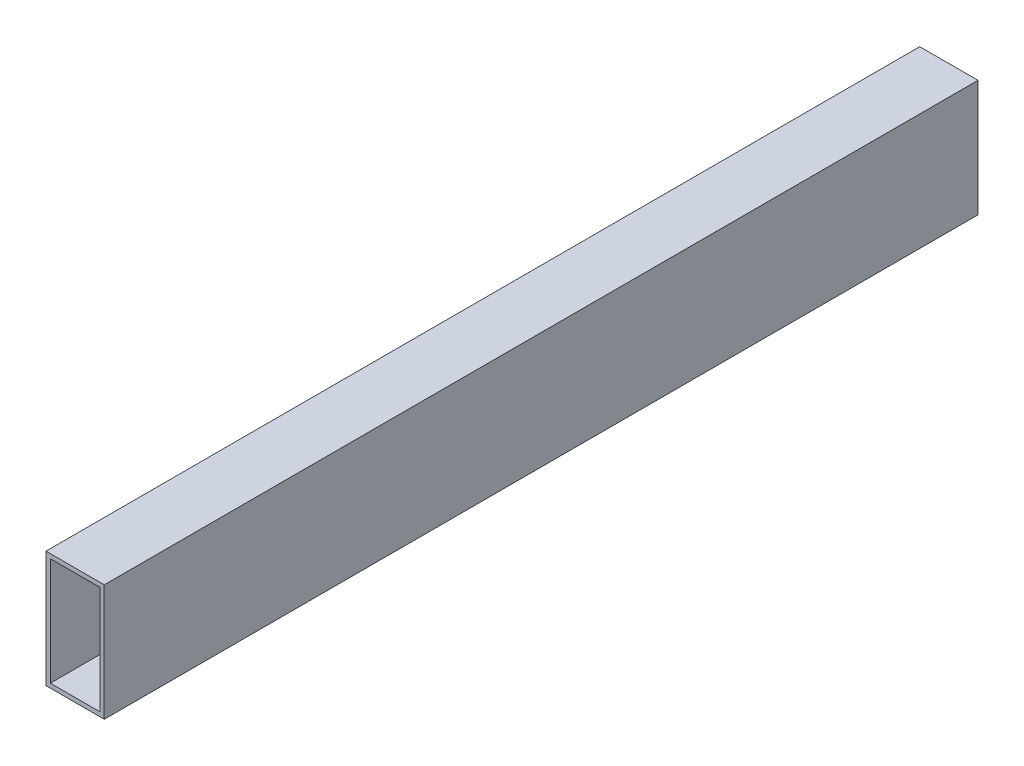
from build123d import *

# Parameters (mm, degrees)
ESQUISSE1_W          = 40
ESQUISSE1_H          = 80
ESQUISSE1_W_2        = 34
ESQUISSE1_H_2        = 74
BASE_EXTRUSION_DEPTH = 600


with BuildPart() as part:
    # Esquisse1 → Base-Extrusion (new body)
    with BuildSketch(Plane.XY):
        with Locations((-3639.880972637, 3136.406605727)):
            Rectangle(ESQUISSE1_W, ESQUISSE1_H)
        with Locations((-3639.880972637, 3136.406605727)):
            Rectangle(ESQUISSE1_W_2, ESQUISSE1_H_2, mode=Mode.SUBTRACT)
    extrude(amount=BASE_EXTRUSION_DEPTH)


solid = part.part
